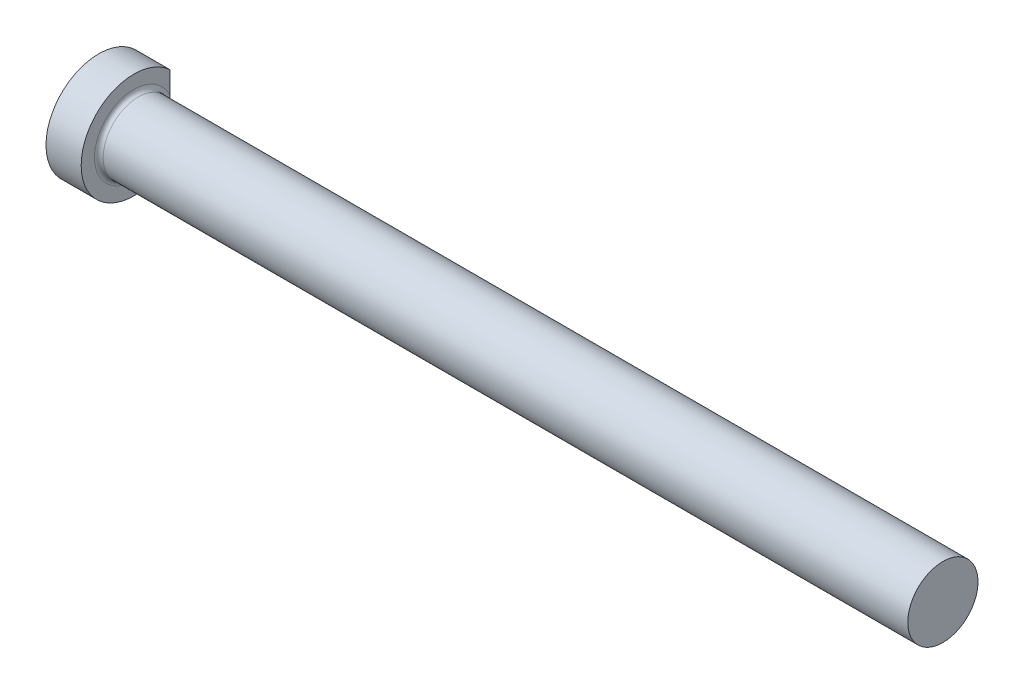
from build123d import *


with BuildPart() as part:
    # Sketch1 → PIN (revolve)
    with BuildSketch(Plane.XY, mode=Mode.PRIVATE) as pin_sk:
        with BuildLine():
            Line((0, 0), (0, 9.525))
            Line((0, 9.525), (6.35, 9.525))
            Line((6.35, 9.525), (6.35, 7.13105))
            ThreePointArc((6.35, 7.13105), (6.58062412, 6.57427412), (7.1374, 6.34365))
            Line((7.1374, 6.34365), (152.4, 6.34365))
            Line((152.4, 6.34365), (152.4, 0))
            Line((152.4, 0), (0, 0))
        make_face()
    revolve(pin_sk.sketch.rotate(Axis((152.4, 0, 0), (-1, 0, 0)), 180), axis=Axis((152.4, 0, 0), (-1, 0, 0)))

    # SurfaceCut1
    split(bisect_by=Plane(origin=(0, 0, -6.52145), x_dir=(-1, 0, 0), z_dir=(0, 0, -1)), keep=Keep.BOTTOM)


solid = part.part
